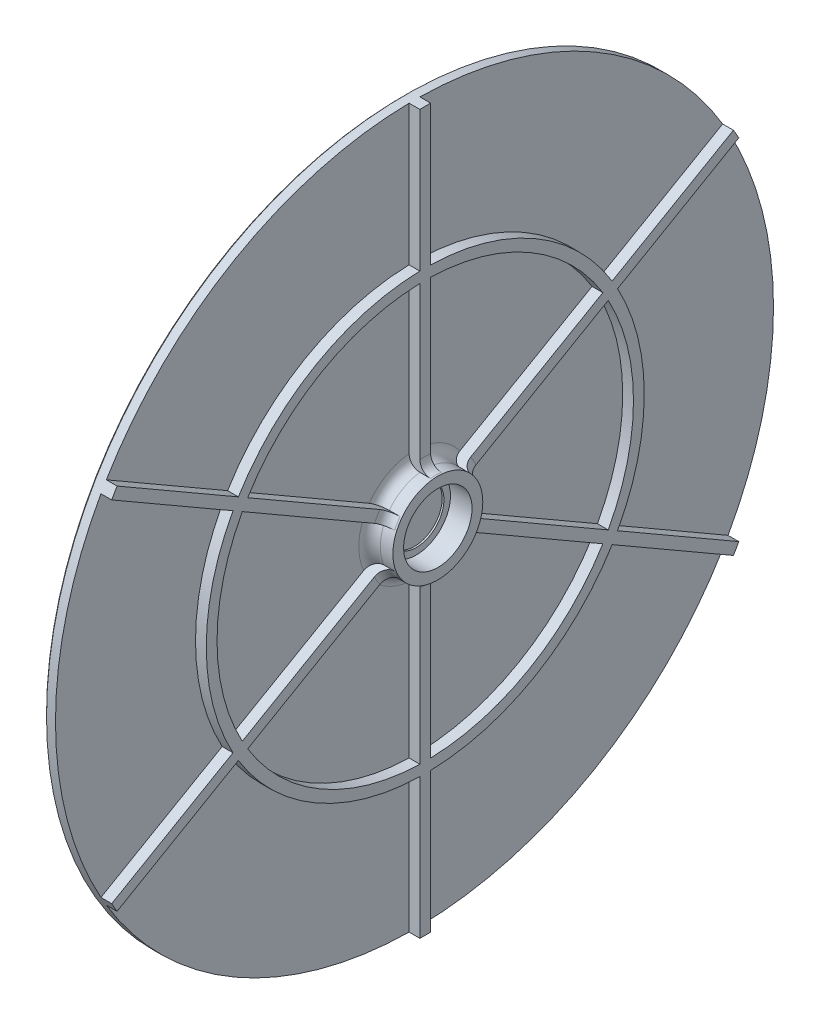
from build123d import *
from build123d.topology import SkipClean

# Parameters (mm, degrees)
SALIENTE_EXTRUIR1_START = 3
SALIENTE_EXTRUIR1_DEPTH = 3
MATRIZC1_COUNT          = 6
REDONDEO1_R             = 3
CHAFL_N1_SIZE           = 0.5


with BuildPart() as part:
    # Croquis1 → Revoluci_n1 (revolve)
    with BuildSketch(Plane.XY, mode=Mode.PRIVATE) as revoluci_n1_sk:
        Polygon((0, 0), (0, 100), (3, 100), (3, 61), (6, 61), (6, 58), (3, 58), (3, 12.525), (9.5, 12.525), (9.5, 9.525), (3.5, 9.525), (3.5, 7.7), (3, 7.7), (3, 0), align=None)
    revolve(revoluci_n1_sk.sketch.rotate(Axis((3, 0, 0), (-1, 0, 0)), 90), axis=Axis((3, 0, 0), (-1, 0, 0)))

    # Croquis4 → Saliente-Extruir1 (add)
    with BuildSketch(Plane(origin=(3, 0, 0), x_dir=(0, 0, -1), z_dir=(1, 0, 0)).offset(SALIENTE_EXTRUIR1_START)):
        with BuildLine():
            Line((1.5, 12.434855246), (1.5, 99.988749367))
            ThreePointArc((1.5, 99.988749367), (0, 100), (-1.5, 99.988749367))
            Line((-1.5, 99.988749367), (-1.5, 12.434855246))
            ThreePointArc((-1.5, 12.434855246), (0, 12.525), (1.5, 12.434855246))
        make_face()
    saliente_extruir1 = extrude(amount=-SALIENTE_EXTRUIR1_DEPTH)

    # MatrizC1: Saliente-Extruir1 ×6 about axis
    with SkipClean():  # the faces are left unmerged after this step: merging them gives an invalid solid
        matrizc1_axis = Axis((0, 0, 0), (1, 0, 0))
        for i in range(1, MATRIZC1_COUNT):
            add(saliente_extruir1.rotate(matrizc1_axis, i * 360 / MATRIZC1_COUNT))

    # Redondeo1
    redondeo1_edges = [part.edges().sort_by_distance(p)[0] for p in [
        (3, 0, 12.525),
        (3, -10.846968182, 6.2625),
        (3, -10.846968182, -6.2625),
        (3, 2.5101191, -12.270897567),
        (3, 10.846968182, -6.2625),
        (3, 10.846968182, 6.2625),
        (6, 6.2625, 10.846968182),
        (6, 12.525, 0),
        (6, 6.2625, -10.846968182),
        (6, -6.2625, -10.846968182),
        (6, -12.525, 0),
        (6, -6.2625, 10.846968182),
    ]]
    fillet(redondeo1_edges, radius=REDONDEO1_R)

    # Chafl_n1
    chafl_n1_edges = [part.edges().sort_by_distance(p)[0] for p in [
        (0, 0, 100),
    ]]
    chamfer(chafl_n1_edges, length=CHAFL_N1_SIZE)


solid = part.part
